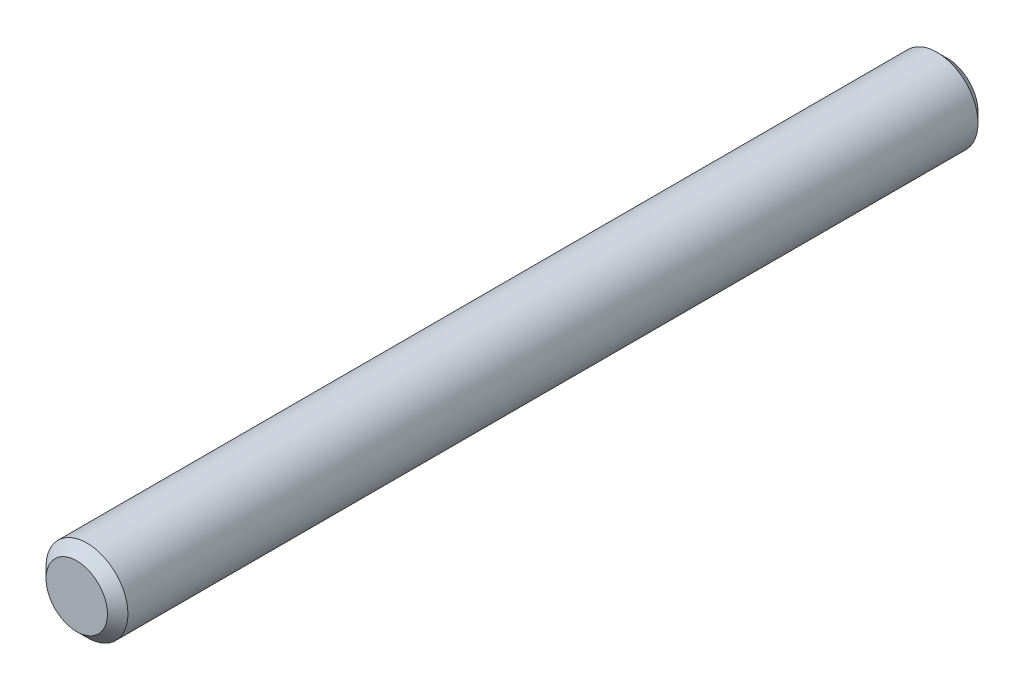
ISO-10303-21;
HEADER;
FILE_DESCRIPTION(('STEP AP214'),'2;1');
FILE_NAME('part.step','',(''),(''),'','','');
FILE_SCHEMA(('AUTOMOTIVE_DESIGN { 1 0 10303 214 1 1 1 1 }'));
ENDSEC;
DATA;
#1=APPLICATION_CONTEXT('core data for automotive mechanical design processes');
#2=APPLICATION_PROTOCOL_DEFINITION('international standard','automotive_design',2000,#1);
#3=PRODUCT_CONTEXT('',#1,'mechanical');
#4=PRODUCT('Part','Part','',(#3));
#5=PRODUCT_RELATED_PRODUCT_CATEGORY('part','',(#4));
#6=PRODUCT_DEFINITION_FORMATION('','',#4);
#7=PRODUCT_DEFINITION_CONTEXT('part definition',#1,'design');
#8=PRODUCT_DEFINITION('design','',#6,#7);
#9=PRODUCT_DEFINITION_SHAPE('','',#8);
#10=(LENGTH_UNIT() NAMED_UNIT(*) SI_UNIT(.MILLI.,.METRE.));
#11=(NAMED_UNIT(*) PLANE_ANGLE_UNIT() SI_UNIT($,.RADIAN.));
#12=(NAMED_UNIT(*) SI_UNIT($,.STERADIAN.) SOLID_ANGLE_UNIT());
#13=UNCERTAINTY_MEASURE_WITH_UNIT(LENGTH_MEASURE(1.E-05),#10,'distance_accuracy_value','');
#14=(GEOMETRIC_REPRESENTATION_CONTEXT(3) GLOBAL_UNCERTAINTY_ASSIGNED_CONTEXT((#13)) GLOBAL_UNIT_ASSIGNED_CONTEXT((#10,
#11,#12)) REPRESENTATION_CONTEXT('',''));
#15=CARTESIAN_POINT('',(0.,0.,0.));
#16=DIRECTION('',(0.,0.,1.));
#17=DIRECTION('',(1.,0.,0.));
#18=AXIS2_PLACEMENT_3D('',#15,#16,#17);
#19=CARTESIAN_POINT('',(0.,0.,85.));
#20=DIRECTION('',(0.,0.,-1.));
#21=DIRECTION('',(-1.,0.,0.));
#22=AXIS2_PLACEMENT_3D('',#19,#20,#21);
#23=CYLINDRICAL_SURFACE('',#22,8.);
#24=CARTESIAN_POINT('',(0.,0.,-83.));
#25=DIRECTION('',(0.,0.,1.));
#26=DIRECTION('',(1.,0.,0.));
#27=AXIS2_PLACEMENT_3D('',#24,#25,#26);
#28=CIRCLE('',#27,8.);
#29=CARTESIAN_POINT('',(8.,0.,-83.));
#30=VERTEX_POINT('',#29);
#31=EDGE_CURVE('E39',#30,#30,#28,.T.);
#32=ORIENTED_EDGE('',*,*,#31,.T.);
#33=EDGE_LOOP('',(#32));
#34=FACE_BOUND('',#33,.T.);
#35=CARTESIAN_POINT('',(0.,0.,83.));
#36=DIRECTION('',(0.,0.,1.));
#37=DIRECTION('',(1.,0.,0.));
#38=AXIS2_PLACEMENT_3D('',#35,#36,#37);
#39=CIRCLE('',#38,8.);
#40=CARTESIAN_POINT('',(8.,0.,83.));
#41=VERTEX_POINT('',#40);
#42=EDGE_CURVE('E43',#41,#41,#39,.F.);
#43=ORIENTED_EDGE('',*,*,#42,.T.);
#44=EDGE_LOOP('',(#43));
#45=FACE_BOUND('',#44,.T.);
#46=ADVANCED_FACE('F29',(#34,#45),#23,.T.);
#47=CARTESIAN_POINT('',(0.,0.,85.));
#48=DIRECTION('',(0.,0.,1.));
#49=DIRECTION('',(1.,0.,0.));
#50=AXIS2_PLACEMENT_3D('',#47,#48,#49);
#51=PLANE('',#50);
#52=CARTESIAN_POINT('',(0.,0.,85.));
#53=DIRECTION('',(0.,0.,1.));
#54=DIRECTION('',(1.,0.,0.));
#55=AXIS2_PLACEMENT_3D('',#52,#53,#54);
#56=CIRCLE('',#55,6.);
#57=CARTESIAN_POINT('',(6.,0.,85.));
#58=VERTEX_POINT('',#57);
#59=EDGE_CURVE('E10',#58,#58,#56,.T.);
#60=ORIENTED_EDGE('',*,*,#59,.T.);
#61=EDGE_LOOP('',(#60));
#62=FACE_BOUND('',#61,.T.);
#63=ADVANCED_FACE('F62',(#62),#51,.T.);
#64=CARTESIAN_POINT('',(0.,0.,-85.));
#65=DIRECTION('',(0.,0.,1.));
#66=DIRECTION('',(1.,0.,0.));
#67=AXIS2_PLACEMENT_3D('',#64,#65,#66);
#68=PLANE('',#67);
#69=CARTESIAN_POINT('',(0.,0.,-85.));
#70=DIRECTION('',(0.,0.,1.));
#71=DIRECTION('',(1.,0.,0.));
#72=AXIS2_PLACEMENT_3D('',#69,#70,#71);
#73=CIRCLE('',#72,5.99999999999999);
#74=CARTESIAN_POINT('',(5.99999999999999,0.,-85.));
#75=VERTEX_POINT('',#74);
#76=EDGE_CURVE('E35',#75,#75,#73,.F.);
#77=ORIENTED_EDGE('',*,*,#76,.T.);
#78=EDGE_LOOP('',(#77));
#79=FACE_BOUND('',#78,.T.);
#80=ADVANCED_FACE('F58',(#79),#68,.F.);
#81=CARTESIAN_POINT('',(0.,0.,-83.));
#82=DIRECTION('',(0.,0.,1.));
#83=DIRECTION('',(1.,0.,0.));
#84=AXIS2_PLACEMENT_3D('',#81,#82,#83);
#85=CONICAL_SURFACE('',#84,8.,0.785398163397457);
#86=ORIENTED_EDGE('',*,*,#76,.F.);
#87=EDGE_LOOP('',(#86));
#88=FACE_BOUND('',#87,.T.);
#89=ORIENTED_EDGE('',*,*,#31,.F.);
#90=EDGE_LOOP('',(#89));
#91=FACE_BOUND('',#90,.T.);
#92=ADVANCED_FACE('F53',(#88,#91),#85,.T.);
#93=CARTESIAN_POINT('',(0.,0.,85.));
#94=DIRECTION('',(0.,0.,-1.));
#95=DIRECTION('',(-1.,0.,0.));
#96=AXIS2_PLACEMENT_3D('',#93,#94,#95);
#97=CONICAL_SURFACE('',#96,6.,0.785398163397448);
#98=ORIENTED_EDGE('',*,*,#42,.F.);
#99=EDGE_LOOP('',(#98));
#100=FACE_BOUND('',#99,.T.);
#101=ORIENTED_EDGE('',*,*,#59,.F.);
#102=EDGE_LOOP('',(#101));
#103=FACE_BOUND('',#102,.T.);
#104=ADVANCED_FACE('F50',(#100,#103),#97,.T.);
#105=CLOSED_SHELL('',(#46,#63,#80,#92,#104));
#106=MANIFOLD_SOLID_BREP('B2',#105);
#107=ADVANCED_BREP_SHAPE_REPRESENTATION('',(#18,#106),#14);
#108=SHAPE_DEFINITION_REPRESENTATION(#9,#107);
ENDSEC;
END-ISO-10303-21;
